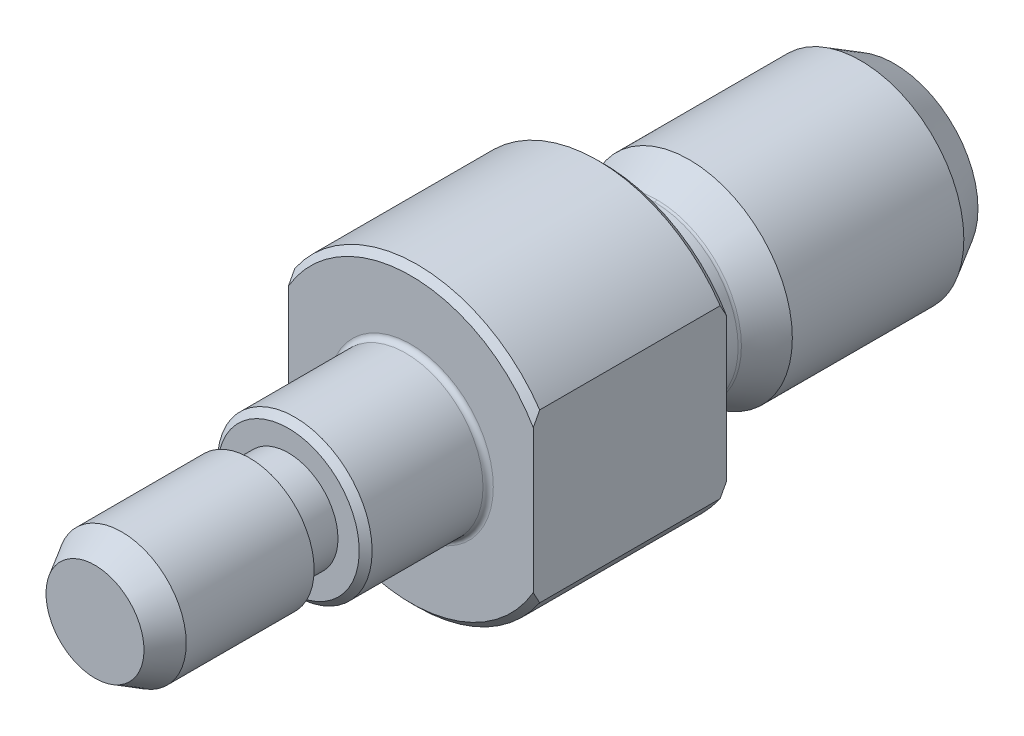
ISO-10303-21;
HEADER;
FILE_DESCRIPTION(('STEP AP214'),'2;1');
FILE_NAME('part.step','',(''),(''),'','','');
FILE_SCHEMA(('AUTOMOTIVE_DESIGN { 1 0 10303 214 1 1 1 1 }'));
ENDSEC;
DATA;
#1=APPLICATION_CONTEXT('core data for automotive mechanical design processes');
#2=APPLICATION_PROTOCOL_DEFINITION('international standard','automotive_design',2000,#1);
#3=PRODUCT_CONTEXT('',#1,'mechanical');
#4=PRODUCT('Part','Part','',(#3));
#5=PRODUCT_RELATED_PRODUCT_CATEGORY('part','',(#4));
#6=PRODUCT_DEFINITION_FORMATION('','',#4);
#7=PRODUCT_DEFINITION_CONTEXT('part definition',#1,'design');
#8=PRODUCT_DEFINITION('design','',#6,#7);
#9=PRODUCT_DEFINITION_SHAPE('','',#8);
#10=(LENGTH_UNIT() NAMED_UNIT(*) SI_UNIT(.MILLI.,.METRE.));
#11=(NAMED_UNIT(*) PLANE_ANGLE_UNIT() SI_UNIT($,.RADIAN.));
#12=(NAMED_UNIT(*) SI_UNIT($,.STERADIAN.) SOLID_ANGLE_UNIT());
#13=UNCERTAINTY_MEASURE_WITH_UNIT(LENGTH_MEASURE(1.E-05),#10,'distance_accuracy_value','');
#14=(GEOMETRIC_REPRESENTATION_CONTEXT(3) GLOBAL_UNCERTAINTY_ASSIGNED_CONTEXT((#13)) GLOBAL_UNIT_ASSIGNED_CONTEXT((#10,
#11,#12)) REPRESENTATION_CONTEXT('',''));
#15=CARTESIAN_POINT('',(0.,0.,0.));
#16=DIRECTION('',(0.,0.,1.));
#17=DIRECTION('',(1.,0.,0.));
#18=AXIS2_PLACEMENT_3D('',#15,#16,#17);
#19=CARTESIAN_POINT('',(-3.858832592,3.84560000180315,39.4999999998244));
#20=DIRECTION('',(0.,4.56493102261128E-11,1.));
#21=DIRECTION('',(0.,-1.,4.56493102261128E-11));
#22=AXIS2_PLACEMENT_3D('',#19,#20,#21);
#23=PLANE('',#22);
#24=CARTESIAN_POINT('',(0.,1.80314775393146E-09,39.5));
#25=DIRECTION('',(0.,-4.56493102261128E-11,-1.));
#26=DIRECTION('',(-1.,0.,0.));
#27=AXIS2_PLACEMENT_3D('',#24,#25,#26);
#28=CIRCLE('',#27,3.8);
#29=CARTESIAN_POINT('',(-3.8,1.80314775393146E-09,39.5));
#30=VERTEX_POINT('',#29);
#31=EDGE_CURVE('E19',#30,#30,#28,.T.);
#32=ORIENTED_EDGE('',*,*,#31,.F.);
#33=EDGE_LOOP('',(#32));
#34=FACE_BOUND('',#33,.T.);
#35=ADVANCED_FACE('F14',(#34),#23,.T.);
#36=CARTESIAN_POINT('',(0.,1.80314775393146E-09,39.5));
#37=DIRECTION('',(0.,-4.56493102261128E-11,-1.));
#38=DIRECTION('',(-1.,0.,0.));
#39=AXIS2_PLACEMENT_3D('',#36,#37,#38);
#40=CONICAL_SURFACE('',#39,3.8,0.523598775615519);
#41=ORIENTED_EDGE('',*,*,#31,.T.);
#42=EDGE_LOOP('',(#41));
#43=FACE_BOUND('',#42,.T.);
#44=CARTESIAN_POINT('',(0.,1.70826744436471E-09,37.421539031));
#45=DIRECTION('',(0.,4.56493102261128E-11,1.));
#46=DIRECTION('',(0.,-1.,4.56493102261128E-11));
#47=AXIS2_PLACEMENT_3D('',#44,#45,#46);
#48=CIRCLE('',#47,5.);
#49=CARTESIAN_POINT('',(0.,-4.99999999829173,37.4215390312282));
#50=VERTEX_POINT('',#49);
#51=EDGE_CURVE('E132',#50,#50,#48,.F.);
#52=ORIENTED_EDGE('',*,*,#51,.F.);
#53=EDGE_LOOP('',(#52));
#54=FACE_BOUND('',#53,.T.);
#55=ADVANCED_FACE('F358',(#43,#54),#40,.T.);
#56=CARTESIAN_POINT('',(0.,1.2553560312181E-09,27.5));
#57=DIRECTION('',(0.,4.56493102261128E-11,1.));
#58=DIRECTION('',(1.,0.,0.));
#59=AXIS2_PLACEMENT_3D('',#56,#57,#58);
#60=CYLINDRICAL_SURFACE('',#59,5.);
#61=CARTESIAN_POINT('',(0.,1.2553560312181E-09,27.5));
#62=DIRECTION('',(0.,4.56493102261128E-11,1.));
#63=DIRECTION('',(1.,0.,0.));
#64=AXIS2_PLACEMENT_3D('',#61,#62,#63);
#65=CIRCLE('',#64,5.);
#66=CARTESIAN_POINT('',(5.,1.2553560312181E-09,27.5));
#67=VERTEX_POINT('',#66);
#68=EDGE_CURVE('E134',#67,#67,#65,.F.);
#69=ORIENTED_EDGE('',*,*,#68,.F.);
#70=EDGE_LOOP('',(#69));
#71=FACE_BOUND('',#70,.T.);
#72=ORIENTED_EDGE('',*,*,#51,.T.);
#73=EDGE_LOOP('',(#72));
#74=FACE_BOUND('',#73,.T.);
#75=ADVANCED_FACE('F354',(#71,#74),#60,.T.);
#76=CARTESIAN_POINT('',(-6.600634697,-6.57800000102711,-22.4999999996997));
#77=DIRECTION('',(0.,-4.56493102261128E-11,-1.));
#78=DIRECTION('',(0.,1.,-4.56493102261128E-11));
#79=AXIS2_PLACEMENT_3D('',#76,#77,#78);
#80=PLANE('',#79);
#81=CARTESIAN_POINT('',(0.,-1.02710948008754E-09,-22.5));
#82=DIRECTION('',(0.,4.56493102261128E-11,1.));
#83=DIRECTION('',(1.,0.,0.));
#84=AXIS2_PLACEMENT_3D('',#81,#82,#83);
#85=CIRCLE('',#84,6.5);
#86=CARTESIAN_POINT('',(6.5,-1.02710948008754E-09,-22.5));
#87=VERTEX_POINT('',#86);
#88=EDGE_CURVE('E347',#87,#87,#85,.T.);
#89=ORIENTED_EDGE('',*,*,#88,.F.);
#90=EDGE_LOOP('',(#89));
#91=FACE_BOUND('',#90,.T.);
#92=ADVANCED_FACE('F357',(#91),#80,.T.);
#93=CARTESIAN_POINT('',(-5.077411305,-5.05999999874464,27.500000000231));
#94=DIRECTION('',(0.,-4.56493102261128E-11,-1.));
#95=DIRECTION('',(0.,1.,-4.56493102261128E-11));
#96=AXIS2_PLACEMENT_3D('',#93,#94,#95);
#97=PLANE('',#96);
#98=CARTESIAN_POINT('',(0.,1.2553560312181E-09,27.5));
#99=DIRECTION('',(0.,4.56493102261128E-11,1.));
#100=DIRECTION('',(1.,0.,0.));
#101=AXIS2_PLACEMENT_3D('',#98,#99,#100);
#102=CIRCLE('',#101,3.85);
#103=CARTESIAN_POINT('',(3.85,1.2553560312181E-09,27.5));
#104=VERTEX_POINT('',#103);
#105=EDGE_CURVE('E131',#104,#104,#102,.F.);
#106=ORIENTED_EDGE('',*,*,#105,.F.);
#107=EDGE_LOOP('',(#106));
#108=FACE_BOUND('',#107,.T.);
#109=ORIENTED_EDGE('',*,*,#68,.T.);
#110=EDGE_LOOP('',(#109));
#111=FACE_BOUND('',#110,.T.);
#112=ADVANCED_FACE('F352',(#108,#111),#97,.T.);
#113=CARTESIAN_POINT('',(0.,-1.02710948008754E-09,-22.5));
#114=DIRECTION('',(0.,4.56493102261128E-11,1.));
#115=DIRECTION('',(1.,0.,0.));
#116=AXIS2_PLACEMENT_3D('',#113,#114,#115);
#117=CONICAL_SURFACE('',#116,6.5,0.523598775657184);
#118=ORIENTED_EDGE('',*,*,#88,.T.);
#119=EDGE_LOOP('',(#118));
#120=FACE_BOUND('',#119,.T.);
#121=CARTESIAN_POINT('',(0.,-9.08509093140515E-10,-19.901923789));
#122=DIRECTION('',(0.,4.56493102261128E-11,1.));
#123=DIRECTION('',(0.,-1.,4.56493102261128E-11));
#124=AXIS2_PLACEMENT_3D('',#121,#122,#123);
#125=CIRCLE('',#124,8.);
#126=CARTESIAN_POINT('',(0.,-8.00000000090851,-19.9019237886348));
#127=VERTEX_POINT('',#126);
#128=EDGE_CURVE('E128',#127,#127,#125,.T.);
#129=ORIENTED_EDGE('',*,*,#128,.F.);
#130=EDGE_LOOP('',(#129));
#131=FACE_BOUND('',#130,.T.);
#132=ADVANCED_FACE('F372',(#120,#131),#117,.T.);
#133=CARTESIAN_POINT('',(0.,1.11840810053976E-09,24.5));
#134=DIRECTION('',(0.,4.56493102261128E-11,1.));
#135=DIRECTION('',(1.,0.,0.));
#136=AXIS2_PLACEMENT_3D('',#133,#134,#135);
#137=CYLINDRICAL_SURFACE('',#136,3.85);
#138=CARTESIAN_POINT('',(0.,1.11840810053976E-09,24.5));
#139=DIRECTION('',(0.,4.56493102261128E-11,1.));
#140=DIRECTION('',(1.,0.,0.));
#141=AXIS2_PLACEMENT_3D('',#138,#139,#140);
#142=CIRCLE('',#141,3.85);
#143=CARTESIAN_POINT('',(3.85,1.11840810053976E-09,24.5));
#144=VERTEX_POINT('',#143);
#145=EDGE_CURVE('E127',#144,#144,#142,.F.);
#146=ORIENTED_EDGE('',*,*,#145,.F.);
#147=EDGE_LOOP('',(#146));
#148=FACE_BOUND('',#147,.T.);
#149=ORIENTED_EDGE('',*,*,#105,.T.);
#150=EDGE_LOOP('',(#149));
#151=FACE_BOUND('',#150,.T.);
#152=ADVANCED_FACE('F375',(#148,#151),#137,.T.);
#153=CARTESIAN_POINT('',(0.,-9.08509093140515E-10,-19.901923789));
#154=DIRECTION('',(0.,4.56493102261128E-11,1.));
#155=DIRECTION('',(1.,0.,0.));
#156=AXIS2_PLACEMENT_3D('',#153,#154,#155);
#157=CYLINDRICAL_SURFACE('',#156,8.);
#158=ORIENTED_EDGE('',*,*,#128,.T.);
#159=EDGE_LOOP('',(#158));
#160=FACE_BOUND('',#159,.T.);
#161=CARTESIAN_POINT('',(0.,-3.01197627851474E-10,-6.598076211));
#162=DIRECTION('',(0.,-4.56493102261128E-11,-1.));
#163=DIRECTION('',(0.,1.,-4.56449734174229E-11));
#164=AXIS2_PLACEMENT_3D('',#161,#162,#163);
#165=CIRCLE('',#164,8.);
#166=CARTESIAN_POINT('',(0.,7.9999999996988,-6.59807621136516));
#167=VERTEX_POINT('',#166);
#168=EDGE_CURVE('E124',#167,#167,#165,.F.);
#169=ORIENTED_EDGE('',*,*,#168,.F.);
#170=EDGE_LOOP('',(#169));
#171=FACE_BOUND('',#170,.T.);
#172=ADVANCED_FACE('F378',(#160,#171),#157,.T.);
#173=CARTESIAN_POINT('',(-5.585152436,5.56600000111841,24.4999999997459));
#174=DIRECTION('',(0.,4.56493102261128E-11,1.));
#175=DIRECTION('',(0.,-1.,4.56493102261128E-11));
#176=AXIS2_PLACEMENT_3D('',#173,#174,#175);
#177=PLANE('',#176);
#178=ORIENTED_EDGE('',*,*,#145,.T.);
#179=EDGE_LOOP('',(#178));
#180=FACE_BOUND('',#179,.T.);
#181=CARTESIAN_POINT('',(0.,1.11840810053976E-09,24.5));
#182=DIRECTION('',(0.,-4.56493102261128E-11,-1.));
#183=DIRECTION('',(-1.,0.,0.));
#184=AXIS2_PLACEMENT_3D('',#181,#182,#183);
#185=CIRCLE('',#184,5.5);
#186=CARTESIAN_POINT('',(-5.5,1.11840810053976E-09,24.5));
#187=VERTEX_POINT('',#186);
#188=EDGE_CURVE('E107',#187,#187,#185,.T.);
#189=ORIENTED_EDGE('',*,*,#188,.F.);
#190=EDGE_LOOP('',(#189));
#191=FACE_BOUND('',#190,.T.);
#192=ADVANCED_FACE('F304',(#180,#191),#177,.T.);
#193=CARTESIAN_POINT('',(0.,-1.86834424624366E-10,-4.092820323));
#194=DIRECTION('',(0.,-4.56493102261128E-11,-1.));
#195=DIRECTION('',(-1.,0.,0.));
#196=AXIS2_PLACEMENT_3D('',#193,#194,#195);
#197=CONICAL_SURFACE('',#196,6.553589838,0.523598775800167);
#198=CARTESIAN_POINT('',(0.,-1.86834424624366E-10,-4.092820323));
#199=DIRECTION('',(0.,-4.56493102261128E-11,-1.));
#200=DIRECTION('',(-1.,0.,0.));
#201=AXIS2_PLACEMENT_3D('',#198,#199,#200);
#202=CIRCLE('',#201,6.553589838);
#203=CARTESIAN_POINT('',(-2.94235305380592E-10,6.55358983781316,-4.09282032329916));
#204=VERTEX_POINT('',#203);
#205=CARTESIAN_POINT('',(-6.72081872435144E-10,-6.55358983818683,-4.09282032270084));
#206=VERTEX_POINT('',#205);
#207=EDGE_CURVE('E102',#204,#206,#202,.T.);
#208=ORIENTED_EDGE('',*,*,#207,.T.);
#209=CARTESIAN_POINT('',(0.,-1.86834424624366E-10,-4.092820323));
#210=DIRECTION('',(0.,-4.56493102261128E-11,-1.));
#211=DIRECTION('',(-1.,0.,0.));
#212=AXIS2_PLACEMENT_3D('',#209,#210,#211);
#213=CIRCLE('',#212,6.553589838);
#214=EDGE_CURVE('E100',#206,#204,#213,.T.);
#215=ORIENTED_EDGE('',*,*,#214,.T.);
#216=EDGE_LOOP('',(#208,#215));
#217=FACE_BOUND('',#216,.T.);
#218=ORIENTED_EDGE('',*,*,#168,.T.);
#219=EDGE_LOOP('',(#218));
#220=FACE_BOUND('',#219,.T.);
#221=ADVANCED_FACE('F103',(#217,#220),#197,.T.);
#222=CARTESIAN_POINT('',(0.,1.11840810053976E-09,24.5));
#223=DIRECTION('',(0.,-4.56493102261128E-11,-1.));
#224=DIRECTION('',(-1.,0.,0.));
#225=AXIS2_PLACEMENT_3D('',#222,#223,#224);
#226=CONICAL_SURFACE('',#225,5.5,0.785398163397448);
#227=ORIENTED_EDGE('',*,*,#188,.T.);
#228=EDGE_LOOP('',(#227));
#229=FACE_BOUND('',#228,.T.);
#230=CARTESIAN_POINT('',(0.,1.09558344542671E-09,24.));
#231=DIRECTION('',(0.,4.56493102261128E-11,1.));
#232=DIRECTION('',(0.,-1.,4.56493102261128E-11));
#233=AXIS2_PLACEMENT_3D('',#230,#231,#232);
#234=CIRCLE('',#233,6.);
#235=CARTESIAN_POINT('',(0.,-5.99999999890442,24.0000000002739));
#236=VERTEX_POINT('',#235);
#237=EDGE_CURVE('E117',#236,#236,#234,.F.);
#238=ORIENTED_EDGE('',*,*,#237,.F.);
#239=EDGE_LOOP('',(#238));
#240=FACE_BOUND('',#239,.T.);
#241=ADVANCED_FACE('F293',(#229,#240),#226,.T.);
#242=CARTESIAN_POINT('',(0.,-6.55358983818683,-4.09282032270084));
#243=CARTESIAN_POINT('',(13.107179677,-6.55358983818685,-4.09282032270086));
#244=CARTESIAN_POINT('',(13.107179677,6.55358983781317,-4.09282032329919));
#245=CARTESIAN_POINT('',(0.,6.55358983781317,-4.09282032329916));
#246=CARTESIAN_POINT('',(0.,-6.51827849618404,-4.03165928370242));
#247=CARTESIAN_POINT('',(13.036556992,-6.51827849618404,-4.03165928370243));
#248=CARTESIAN_POINT('',(13.036556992,6.51827849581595,-4.03165928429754));
#249=CARTESIAN_POINT('',(0.,6.51827849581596,-4.03165928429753));
#250=CARTESIAN_POINT('',(0.,-6.50000000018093,-3.96344300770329));
#251=CARTESIAN_POINT('',(13.,-6.50000000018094,-3.96344300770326));
#252=CARTESIAN_POINT('',(13.,6.49999999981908,-3.9634430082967));
#253=CARTESIAN_POINT('',(0.,6.49999999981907,-3.96344300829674));
#254=CARTESIAN_POINT('',(0.,-6.5000000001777,-3.89282032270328));
#255=CARTESIAN_POINT('',(13.,-6.50000000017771,-3.89282032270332));
#256=CARTESIAN_POINT('',(13.,6.4999999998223,-3.89282032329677));
#257=CARTESIAN_POINT('',(0.,6.4999999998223,-3.89282032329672));
#258=(BOUNDED_SURFACE() B_SPLINE_SURFACE(3,3,((#242,#243,#244,#245),(#246,#247,#248,#249),(#250,
#251,#252,#253),(#254,#255,#256,#257)),.UNSPECIFIED.,.F.,.F.,
.F.) B_SPLINE_SURFACE_WITH_KNOTS((4,4),(4,4),(0.,1.),(0.,1.),
.UNSPECIFIED.) GEOMETRIC_REPRESENTATION_ITEM() RATIONAL_B_SPLINE_SURFACE(((1.,0.333333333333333,
0.333333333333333,1.),(0.977283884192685,0.325761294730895,0.325761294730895,0.977283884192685),
(0.977283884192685,0.325761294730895,0.325761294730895,0.977283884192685),(1.,0.333333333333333,
0.333333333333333,1.))) REPRESENTATION_ITEM('') SURFACE());
#259=CARTESIAN_POINT('',(0.,-1.77704562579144E-10,-3.892820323));
#260=DIRECTION('',(0.,4.56493102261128E-11,1.));
#261=DIRECTION('',(0.,-1.,4.56493102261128E-11));
#262=AXIS2_PLACEMENT_3D('',#259,#260,#261);
#263=CIRCLE('',#262,6.5);
#264=CARTESIAN_POINT('',(-8.75487877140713E-10,-6.5000000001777,-3.89282032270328));
#265=VERTEX_POINT('',#264);
#266=CARTESIAN_POINT('',(-1.9997584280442E-09,6.4999999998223,-3.89282032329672));
#267=VERTEX_POINT('',#266);
#268=EDGE_CURVE('E92',#265,#267,#263,.T.);
#269=CARTESIAN_POINT('',(0.,-6.55358983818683,-4.09282032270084));
#270=CARTESIAN_POINT('',(0.,-6.51827849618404,-4.03165928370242));
#271=CARTESIAN_POINT('',(0.,-6.50000000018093,-3.96344300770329));
#272=CARTESIAN_POINT('',(0.,-6.5000000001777,-3.89282032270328));
#273=(BOUNDED_CURVE() B_SPLINE_CURVE(3,(#269,#270,#271,#272),.UNSPECIFIED.,.F.,
.F.) B_SPLINE_CURVE_WITH_KNOTS((4,4),(0.,1.),
.UNSPECIFIED.) CURVE() GEOMETRIC_REPRESENTATION_ITEM() RATIONAL_B_SPLINE_CURVE((1.,
0.977283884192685,0.977283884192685,1.)) REPRESENTATION_ITEM(''));
#274=EDGE_CURVE('E106',#265,#206,#273,.F.);
#275=CARTESIAN_POINT('',(0.,6.55358983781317,-4.09282032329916));
#276=CARTESIAN_POINT('',(0.,6.51827849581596,-4.03165928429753));
#277=CARTESIAN_POINT('',(0.,6.49999999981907,-3.96344300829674));
#278=CARTESIAN_POINT('',(0.,6.4999999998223,-3.89282032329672));
#279=(BOUNDED_CURVE() B_SPLINE_CURVE(3,(#275,#276,#277,#278),.UNSPECIFIED.,.F.,
.F.) B_SPLINE_CURVE_WITH_KNOTS((4,4),(0.,1.),
.UNSPECIFIED.) CURVE() GEOMETRIC_REPRESENTATION_ITEM() RATIONAL_B_SPLINE_CURVE((1.,
0.977283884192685,0.977283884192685,1.)) REPRESENTATION_ITEM(''));
#280=EDGE_CURVE('E115',#204,#267,#279,.T.);
#281=ORIENTED_EDGE('',*,*,#268,.F.);
#282=ORIENTED_EDGE('',*,*,#274,.T.);
#283=ORIENTED_EDGE('',*,*,#207,.F.);
#284=ORIENTED_EDGE('',*,*,#280,.T.);
#285=EDGE_LOOP('',(#281,#282,#283,#284));
#286=FACE_BOUND('',#285,.T.);
#287=ADVANCED_FACE('F109',(#286),#258,.F.);
#288=CARTESIAN_POINT('',(0.,6.55358983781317,-4.09282032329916));
#289=CARTESIAN_POINT('',(-13.107179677,6.55358983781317,-4.09282032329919));
#290=CARTESIAN_POINT('',(-13.107179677,-6.55358983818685,-4.09282032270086));
#291=CARTESIAN_POINT('',(0.,-6.55358983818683,-4.09282032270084));
#292=CARTESIAN_POINT('',(0.,6.51827849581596,-4.03165928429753));
#293=CARTESIAN_POINT('',(-13.036556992,6.51827849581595,-4.03165928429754));
#294=CARTESIAN_POINT('',(-13.036556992,-6.51827849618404,-4.03165928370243));
#295=CARTESIAN_POINT('',(0.,-6.51827849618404,-4.03165928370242));
#296=CARTESIAN_POINT('',(0.,6.49999999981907,-3.96344300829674));
#297=CARTESIAN_POINT('',(-13.,6.49999999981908,-3.9634430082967));
#298=CARTESIAN_POINT('',(-13.,-6.50000000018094,-3.96344300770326));
#299=CARTESIAN_POINT('',(0.,-6.50000000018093,-3.96344300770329));
#300=CARTESIAN_POINT('',(0.,6.4999999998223,-3.89282032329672));
#301=CARTESIAN_POINT('',(-13.,6.4999999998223,-3.89282032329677));
#302=CARTESIAN_POINT('',(-13.,-6.50000000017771,-3.89282032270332));
#303=CARTESIAN_POINT('',(0.,-6.5000000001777,-3.89282032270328));
#304=(BOUNDED_SURFACE() B_SPLINE_SURFACE(3,3,((#288,#289,#290,#291),(#292,#293,#294,#295),(#296,
#297,#298,#299),(#300,#301,#302,#303)),.UNSPECIFIED.,.F.,.F.,
.F.) B_SPLINE_SURFACE_WITH_KNOTS((4,4),(4,4),(0.,1.),(0.,1.),
.UNSPECIFIED.) GEOMETRIC_REPRESENTATION_ITEM() RATIONAL_B_SPLINE_SURFACE(((1.,0.333333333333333,
0.333333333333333,1.),(0.977283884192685,0.325761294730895,0.325761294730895,0.977283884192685),
(0.977283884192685,0.325761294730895,0.325761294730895,0.977283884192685),(1.,0.333333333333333,
0.333333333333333,1.))) REPRESENTATION_ITEM('') SURFACE());
#305=CARTESIAN_POINT('',(0.,-1.77704562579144E-10,-3.892820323));
#306=DIRECTION('',(0.,4.56493102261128E-11,1.));
#307=DIRECTION('',(0.,-1.,4.56493102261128E-11));
#308=AXIS2_PLACEMENT_3D('',#305,#306,#307);
#309=CIRCLE('',#308,6.5);
#310=EDGE_CURVE('E267',#267,#265,#309,.T.);
#311=ORIENTED_EDGE('',*,*,#280,.F.);
#312=ORIENTED_EDGE('',*,*,#214,.F.);
#313=ORIENTED_EDGE('',*,*,#274,.F.);
#314=ORIENTED_EDGE('',*,*,#310,.F.);
#315=EDGE_LOOP('',(#311,#312,#313,#314));
#316=FACE_BOUND('',#315,.T.);
#317=ADVANCED_FACE('F114',(#316),#304,.F.);
#318=CARTESIAN_POINT('',(0.,7.02999377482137E-10,15.4));
#319=DIRECTION('',(0.,4.56493102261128E-11,1.));
#320=DIRECTION('',(1.,0.,0.));
#321=AXIS2_PLACEMENT_3D('',#318,#319,#320);
#322=CYLINDRICAL_SURFACE('',#321,6.);
#323=CARTESIAN_POINT('',(0.,7.02999377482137E-10,15.4));
#324=DIRECTION('',(0.,4.56493102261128E-11,1.));
#325=DIRECTION('',(1.,0.,0.));
#326=AXIS2_PLACEMENT_3D('',#323,#324,#325);
#327=CIRCLE('',#326,6.);
#328=CARTESIAN_POINT('',(6.,7.02999377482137E-10,15.4));
#329=VERTEX_POINT('',#328);
#330=EDGE_CURVE('E264',#329,#329,#327,.T.);
#331=ORIENTED_EDGE('',*,*,#330,.T.);
#332=EDGE_LOOP('',(#331));
#333=FACE_BOUND('',#332,.T.);
#334=ORIENTED_EDGE('',*,*,#237,.T.);
#335=EDGE_LOOP('',(#334));
#336=FACE_BOUND('',#335,.T.);
#337=ADVANCED_FACE('F291',(#333,#336),#322,.T.);
#338=CARTESIAN_POINT('',(0.,-1.77704562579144E-10,-3.892820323));
#339=DIRECTION('',(0.,4.56493102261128E-11,1.));
#340=DIRECTION('',(1.,0.,0.));
#341=AXIS2_PLACEMENT_3D('',#338,#339,#340);
#342=CYLINDRICAL_SURFACE('',#341,6.5);
#343=ORIENTED_EDGE('',*,*,#268,.T.);
#344=ORIENTED_EDGE('',*,*,#310,.T.);
#345=EDGE_LOOP('',(#343,#344));
#346=FACE_BOUND('',#345,.T.);
#347=CARTESIAN_POINT('',(0.,-1.82597240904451E-11,-0.4));
#348=DIRECTION('',(0.,-4.56493102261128E-11,-1.));
#349=DIRECTION('',(-1.,0.,0.));
#350=AXIS2_PLACEMENT_3D('',#347,#348,#349);
#351=CIRCLE('',#350,6.5);
#352=CARTESIAN_POINT('',(-6.5,-1.82597240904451E-11,-0.4));
#353=VERTEX_POINT('',#352);
#354=EDGE_CURVE('E261',#353,#353,#351,.T.);
#355=ORIENTED_EDGE('',*,*,#354,.T.);
#356=EDGE_LOOP('',(#355));
#357=FACE_BOUND('',#356,.T.);
#358=ADVANCED_FACE('F327',(#346,#357),#342,.T.);
#359=CARTESIAN_POINT('',(0.,7.02999377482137E-10,15.4));
#360=DIRECTION('',(0.,4.56493102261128E-11,1.));
#361=DIRECTION('',(1.,0.,0.));
#362=AXIS2_PLACEMENT_3D('',#359,#360,#361);
#363=TOROIDAL_SURFACE('',#362,6.4,0.4);
#364=CARTESIAN_POINT('',(0.,6.84739653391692E-10,15.));
#365=DIRECTION('',(0.,4.56493102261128E-11,1.));
#366=DIRECTION('',(1.,0.,0.));
#367=AXIS2_PLACEMENT_3D('',#364,#365,#366);
#368=CIRCLE('',#367,6.40000000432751);
#369=CARTESIAN_POINT('',(6.40000000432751,6.84739653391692E-10,15.));
#370=VERTEX_POINT('',#369);
#371=EDGE_CURVE('E341',#370,#370,#368,.F.);
#372=ORIENTED_EDGE('',*,*,#371,.F.);
#373=EDGE_LOOP('',(#372));
#374=FACE_BOUND('',#373,.T.);
#375=ORIENTED_EDGE('',*,*,#330,.F.);
#376=EDGE_LOOP('',(#375));
#377=FACE_BOUND('',#376,.T.);
#378=ADVANCED_FACE('F330',(#374,#377),#363,.F.);
#379=CARTESIAN_POINT('',(0.,-1.82597240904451E-11,-0.4));
#380=DIRECTION('',(0.,4.56493102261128E-11,1.));
#381=DIRECTION('',(1.,0.,0.));
#382=AXIS2_PLACEMENT_3D('',#379,#380,#381);
#383=TOROIDAL_SURFACE('',#382,6.9,0.4);
#384=ORIENTED_EDGE('',*,*,#354,.F.);
#385=EDGE_LOOP('',(#384));
#386=FACE_BOUND('',#385,.T.);
#387=CARTESIAN_POINT('',(0.,0.,0.));
#388=DIRECTION('',(0.,4.56493102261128E-11,1.));
#389=DIRECTION('',(1.,0.,0.));
#390=AXIS2_PLACEMENT_3D('',#387,#388,#389);
#391=CIRCLE('',#390,6.8999999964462);
#392=CARTESIAN_POINT('',(6.8999999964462,0.,0.));
#393=VERTEX_POINT('',#392);
#394=EDGE_CURVE('E164',#393,#393,#391,.T.);
#395=ORIENTED_EDGE('',*,*,#394,.F.);
#396=EDGE_LOOP('',(#395));
#397=FACE_BOUND('',#396,.T.);
#398=ADVANCED_FACE('F179',(#386,#397),#383,.F.);
#399=CARTESIAN_POINT('',(9.5,6.48074069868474,14.9999999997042));
#400=DIRECTION('',(1.,0.,0.));
#401=DIRECTION('',(0.,-1.,4.56493102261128E-11));
#402=AXIS2_PLACEMENT_3D('',#399,#400,#401);
#403=PLANE('',#402);
#404=DIRECTION('',(0.,1.,-4.56493102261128E-11));
#405=VECTOR('',#404,1.);
#406=CARTESIAN_POINT('',(9.5,-0.0461727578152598,15.0000000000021));
#407=LINE('',#406,#405);
#408=CARTESIAN_POINT('',(9.5,-5.54526825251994,15.0000000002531));
#409=VERTEX_POINT('',#408);
#410=CARTESIAN_POINT('',(9.5,5.545268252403,15.0000000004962));
#411=VERTEX_POINT('',#410);
#412=EDGE_CURVE('E254',#409,#411,#407,.T.);
#413=ORIENTED_EDGE('',*,*,#412,.F.);
#414=CARTESIAN_POINT('',(9.4999999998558,-6.48074069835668,14.4999999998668));
#415=CARTESIAN_POINT('',(9.49999999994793,-6.40372265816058,14.5434024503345));
#416=CARTESIAN_POINT('',(9.49999999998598,-6.32647872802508,14.5864052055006));
#417=CARTESIAN_POINT('',(9.50000000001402,-6.17153461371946,14.6715558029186));
#418=CARTESIAN_POINT('',(9.500000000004,-6.09383449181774,14.7137037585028));
#419=CARTESIAN_POINT('',(9.499999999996,-5.93795223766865,14.7971012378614));
#420=CARTESIAN_POINT('',(9.499999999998,-5.85977010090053,14.8383507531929));
#421=CARTESIAN_POINT('',(9.500000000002,-5.70289977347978,14.9199016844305));
#422=CARTESIAN_POINT('',(9.50000000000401,-5.62421151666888,14.9602029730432));
#423=CARTESIAN_POINT('',(9.5,-5.54526824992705,15.0000000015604));
#424=B_SPLINE_CURVE_WITH_KNOTS('',3,(#414,#415,#416,#417,#418,#419,#420,#421,#422,#423),
.UNSPECIFIED.,.F.,.F.,(4,2,2,2,4),(0.,0.265216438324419,0.530397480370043,0.795581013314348,
1.06079994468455),.UNSPECIFIED.);
#425=CARTESIAN_POINT('',(9.50000000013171,-6.48074069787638,14.5000000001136));
#426=VERTEX_POINT('',#425);
#427=EDGE_CURVE('E187',#426,#409,#424,.T.);
#428=ORIENTED_EDGE('',*,*,#427,.F.);
#429=DIRECTION('',(0.,4.56493102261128E-11,1.));
#430=VECTOR('',#429,1.);
#431=CARTESIAN_POINT('',(9.50000000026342,-6.48074069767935,7.50000000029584));
#432=LINE('',#431,#430);
#433=CARTESIAN_POINT('',(9.50000000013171,-6.48074069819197,0.50000000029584));
#434=VERTEX_POINT('',#433);
#435=EDGE_CURVE('E251',#434,#426,#432,.T.);
#436=ORIENTED_EDGE('',*,*,#435,.F.);
#437=CARTESIAN_POINT('',(9.50000000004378,-5.54526824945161,-1.6629614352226E-09));
#438=CARTESIAN_POINT('',(9.50000000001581,-5.62421151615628,0.0397970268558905));
#439=CARTESIAN_POINT('',(9.50000000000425,-5.70289977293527,0.0800983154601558));
#440=CARTESIAN_POINT('',(9.49999999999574,-5.85977010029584,0.161649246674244));
#441=CARTESIAN_POINT('',(9.49999999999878,-5.93795223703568,0.202898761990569));
#442=CARTESIAN_POINT('',(9.50000000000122,-6.09383449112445,0.286296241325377));
#443=CARTESIAN_POINT('',(9.50000000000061,-6.17153461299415,0.328444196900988));
#444=CARTESIAN_POINT('',(9.49999999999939,-6.3264787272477,0.413594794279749));
#445=CARTESIAN_POINT('',(9.49999999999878,-6.40372265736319,0.456597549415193));
#446=CARTESIAN_POINT('',(9.5,-6.48074069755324,0.499999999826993));
#447=B_SPLINE_CURVE_WITH_KNOTS('',3,(#437,#438,#439,#440,#441,#442,#443,#444,#445,#446),
.UNSPECIFIED.,.F.,.F.,(4,2,2,2,4),(0.,0.265218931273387,0.530402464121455,0.79558350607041,
1.06079994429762),.UNSPECIFIED.);
#448=CARTESIAN_POINT('',(9.5,-5.54526825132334,-6.95311863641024E-10));
#449=VERTEX_POINT('',#448);
#450=EDGE_CURVE('E154',#449,#434,#447,.T.);
#451=ORIENTED_EDGE('',*,*,#450,.F.);
#452=DIRECTION('',(0.,-1.,4.56493102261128E-11));
#453=VECTOR('',#452,1.);
#454=CARTESIAN_POINT('',(9.5,0.0461727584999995,-2.1094237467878E-12));
#455=LINE('',#454,#453);
#456=CARTESIAN_POINT('',(9.5,5.54526825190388,-9.08891018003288E-10));
#457=VERTEX_POINT('',#456);
#458=EDGE_CURVE('E234',#457,#449,#455,.T.);
#459=ORIENTED_EDGE('',*,*,#458,.F.);
#460=CARTESIAN_POINT('',(9.49999999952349,6.48074069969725,0.500000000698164));
#461=CARTESIAN_POINT('',(9.49999999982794,6.4037226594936,0.456597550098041));
#462=CARTESIAN_POINT('',(9.49999999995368,6.32647872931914,0.413594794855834));
#463=CARTESIAN_POINT('',(9.50000000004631,6.17153461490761,0.328444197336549));
#464=CARTESIAN_POINT('',(9.50000000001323,6.09383449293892,0.286296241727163));
#465=CARTESIAN_POINT('',(9.49999999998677,5.93795223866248,0.202898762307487));
#466=CARTESIAN_POINT('',(9.49999999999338,5.85977010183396,0.161649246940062));
#467=CARTESIAN_POINT('',(9.50000000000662,5.70289977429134,0.0800983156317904));
#468=CARTESIAN_POINT('',(9.50000000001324,5.62421151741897,0.0397970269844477));
#469=CARTESIAN_POINT('',(9.5,5.54526825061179,-1.56039070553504E-09));
#470=B_SPLINE_CURVE_WITH_KNOTS('',3,(#460,#461,#462,#463,#464,#465,#466,#467,#468,#469),
.UNSPECIFIED.,.F.,.F.,(4,2,2,2,4),(0.,0.265216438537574,0.530397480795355,0.795581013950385,
1.06079994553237),.UNSPECIFIED.);
#471=CARTESIAN_POINT('',(9.49999999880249,6.48074070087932,0.500000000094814));
#472=VERTEX_POINT('',#471);
#473=EDGE_CURVE('E194',#472,#457,#470,.T.);
#474=ORIENTED_EDGE('',*,*,#473,.F.);
#475=DIRECTION('',(0.,-4.56493102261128E-11,-1.));
#476=VECTOR('',#475,1.);
#477=CARTESIAN_POINT('',(9.49999999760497,6.48074070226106,7.49999999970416));
#478=LINE('',#477,#476);
#479=CARTESIAN_POINT('',(9.49999999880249,6.48074070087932,14.4999999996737));
#480=VERTEX_POINT('',#479);
#481=EDGE_CURVE('E250',#480,#472,#478,.T.);
#482=ORIENTED_EDGE('',*,*,#481,.F.);
#483=CARTESIAN_POINT('',(9.49999999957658,6.48074069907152,14.4999999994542));
#484=CARTESIAN_POINT('',(9.49999999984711,6.40372265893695,14.5434024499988));
#485=CARTESIAN_POINT('',(9.49999999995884,6.32647872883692,14.5864052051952));
#486=CARTESIAN_POINT('',(9.50000000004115,6.17153461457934,14.6715558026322));
#487=CARTESIAN_POINT('',(9.50000000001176,6.09383449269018,14.7137037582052));
#488=CARTESIAN_POINT('',(9.49999999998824,5.93795223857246,14.7971012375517));
#489=CARTESIAN_POINT('',(9.49999999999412,5.85977010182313,14.8383507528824));
#490=CARTESIAN_POINT('',(9.50000000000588,5.7028997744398,14.919901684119));
#491=CARTESIAN_POINT('',(9.50000000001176,5.62421151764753,14.9602029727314));
#492=CARTESIAN_POINT('',(9.5,5.54526825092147,15.0000000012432));
#493=B_SPLINE_CURVE_WITH_KNOTS('',3,(#483,#484,#485,#486,#487,#488,#489,#490,#491,#492),
.UNSPECIFIED.,.F.,.F.,(4,2,2,2,4),(0.,0.265216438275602,0.530397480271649,0.795581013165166,
1.06079994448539),.UNSPECIFIED.);
#494=EDGE_CURVE('E80',#480,#411,#493,.T.);
#495=ORIENTED_EDGE('',*,*,#494,.T.);
#496=EDGE_LOOP('',(#413,#428,#436,#451,#459,#474,#482,#495));
#497=FACE_BOUND('',#496,.T.);
#498=ADVANCED_FACE('F173',(#497),#403,.T.);
#499=CARTESIAN_POINT('',(-9.5,11.1325540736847,14.9999999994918));
#500=DIRECTION('',(0.,4.56493102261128E-11,1.));
#501=DIRECTION('',(0.,-1.,4.56493102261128E-11));
#502=AXIS2_PLACEMENT_3D('',#499,#500,#501);
#503=PLANE('',#502);
#504=ORIENTED_EDGE('',*,*,#371,.T.);
#505=EDGE_LOOP('',(#504));
#506=FACE_BOUND('',#505,.T.);
#507=CARTESIAN_POINT('',(0.,6.84739653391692E-10,15.));
#508=DIRECTION('',(0.,-4.56493102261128E-11,-1.));
#509=DIRECTION('',(-1.,0.,0.));
#510=AXIS2_PLACEMENT_3D('',#507,#508,#509);
#511=CIRCLE('',#510,11.);
#512=CARTESIAN_POINT('',(-9.5,-5.54526825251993,15.0000000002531));
#513=VERTEX_POINT('',#512);
#514=EDGE_CURVE('E201',#409,#513,#511,.T.);
#515=ORIENTED_EDGE('',*,*,#514,.F.);
#516=ORIENTED_EDGE('',*,*,#412,.T.);
#517=CARTESIAN_POINT('',(0.,6.84739653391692E-10,15.));
#518=DIRECTION('',(0.,-4.56493102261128E-11,-1.));
#519=DIRECTION('',(-1.,0.,0.));
#520=AXIS2_PLACEMENT_3D('',#517,#518,#519);
#521=CIRCLE('',#520,11.);
#522=CARTESIAN_POINT('',(-9.5,5.54526825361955,14.9999999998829));
#523=VERTEX_POINT('',#522);
#524=EDGE_CURVE('E84',#523,#411,#521,.T.);
#525=ORIENTED_EDGE('',*,*,#524,.F.);
#526=DIRECTION('',(0.,1.,-4.56493102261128E-11));
#527=VECTOR('',#526,1.);
#528=CARTESIAN_POINT('',(-9.5,6.84739653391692E-10,15.));
#529=LINE('',#528,#527);
#530=EDGE_CURVE('E239',#513,#523,#529,.T.);
#531=ORIENTED_EDGE('',*,*,#530,.F.);
#532=EDGE_LOOP('',(#515,#516,#525,#531));
#533=FACE_BOUND('',#532,.T.);
#534=ADVANCED_FACE('F178',(#506,#533),#503,.T.);
#535=CARTESIAN_POINT('',(0.,6.84739653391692E-10,15.));
#536=DIRECTION('',(0.,-4.56493102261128E-11,-1.));
#537=DIRECTION('',(-1.,0.,0.));
#538=AXIS2_PLACEMENT_3D('',#535,#536,#537);
#539=CONICAL_SURFACE('',#538,11.,0.785398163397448);
#540=CARTESIAN_POINT('',(0.,6.61914998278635E-10,14.5));
#541=DIRECTION('',(0.,4.56493102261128E-11,1.));
#542=DIRECTION('',(0.,-1.,4.56493102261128E-11));
#543=AXIS2_PLACEMENT_3D('',#540,#541,#542);
#544=CIRCLE('',#543,11.5);
#545=CARTESIAN_POINT('',(-9.5,6.48074069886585,14.4999999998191));
#546=VERTEX_POINT('',#545);
#547=EDGE_CURVE('E256',#546,#480,#544,.F.);
#548=ORIENTED_EDGE('',*,*,#547,.F.);
#549=CARTESIAN_POINT('',(-9.5,5.54526825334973,15.0000000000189));
#550=CARTESIAN_POINT('',(-9.5,5.6242115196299,14.9602029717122));
#551=CARTESIAN_POINT('',(-9.5,5.70289977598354,14.9199016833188));
#552=CARTESIAN_POINT('',(-9.5,5.8597701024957,14.8383507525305));
#553=CARTESIAN_POINT('',(-9.5,5.93795223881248,14.7971012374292));
#554=CARTESIAN_POINT('',(-9.5,6.09383449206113,14.7137037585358));
#555=CARTESIAN_POINT('',(-9.5,6.17153461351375,14.6715558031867));
#556=CARTESIAN_POINT('',(-9.5,6.32647872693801,14.5864052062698));
#557=CARTESIAN_POINT('',(-9.5,6.40372265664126,14.5434024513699));
#558=CARTESIAN_POINT('',(-9.5,6.48074069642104,14.5000000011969));
#559=B_SPLINE_CURVE_WITH_KNOTS('',3,(#549,#550,#551,#552,#553,#554,#555,#556,#557,#558),
.UNSPECIFIED.,.F.,.F.,(4,2,2,2,4),(0.,0.265218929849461,0.530402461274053,0.795583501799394,
1.06079993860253),.UNSPECIFIED.);
#560=EDGE_CURVE('E165',#523,#546,#559,.T.);
#561=ORIENTED_EDGE('',*,*,#560,.F.);
#562=ORIENTED_EDGE('',*,*,#524,.T.);
#563=ORIENTED_EDGE('',*,*,#494,.F.);
#564=EDGE_LOOP('',(#548,#561,#562,#563));
#565=FACE_BOUND('',#564,.T.);
#566=ADVANCED_FACE('F332',(#565),#539,.T.);
#567=CARTESIAN_POINT('',(0.,2.28246551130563E-11,0.5));
#568=DIRECTION('',(0.,4.56493102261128E-11,1.));
#569=DIRECTION('',(1.,0.,0.));
#570=AXIS2_PLACEMENT_3D('',#567,#568,#569);
#571=CYLINDRICAL_SURFACE('',#570,11.5);
#572=ORIENTED_EDGE('',*,*,#547,.T.);
#573=ORIENTED_EDGE('',*,*,#481,.T.);
#574=CARTESIAN_POINT('',(0.,2.28246551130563E-11,0.5));
#575=DIRECTION('',(0.,4.56493102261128E-11,1.));
#576=DIRECTION('',(0.,-1.,4.56523271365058E-11));
#577=AXIS2_PLACEMENT_3D('',#574,#575,#576);
#578=CIRCLE('',#577,11.5);
#579=CARTESIAN_POINT('',(-9.5,6.48074069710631,0.499999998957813));
#580=VERTEX_POINT('',#579);
#581=EDGE_CURVE('E202',#580,#472,#578,.F.);
#582=ORIENTED_EDGE('',*,*,#581,.F.);
#583=DIRECTION('',(0.,-4.56493102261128E-11,-1.));
#584=VECTOR('',#583,1.);
#585=CARTESIAN_POINT('',(-9.5,6.48074069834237,7.49999999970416));
#586=LINE('',#585,#584);
#587=EDGE_CURVE('E220',#546,#580,#586,.T.);
#588=ORIENTED_EDGE('',*,*,#587,.F.);
#589=EDGE_LOOP('',(#572,#573,#582,#588));
#590=FACE_BOUND('',#589,.T.);
#591=ADVANCED_FACE('F209',(#590),#571,.T.);
#592=CARTESIAN_POINT('',(0.,0.,0.));
#593=DIRECTION('',(0.,4.56493102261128E-11,1.));
#594=DIRECTION('',(1.,0.,0.));
#595=AXIS2_PLACEMENT_3D('',#592,#593,#594);
#596=CONICAL_SURFACE('',#595,11.,0.785398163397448);
#597=ORIENTED_EDGE('',*,*,#581,.T.);
#598=ORIENTED_EDGE('',*,*,#473,.T.);
#599=CARTESIAN_POINT('',(0.,0.,0.));
#600=DIRECTION('',(0.,4.56493102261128E-11,1.));
#601=DIRECTION('',(1.,0.,0.));
#602=AXIS2_PLACEMENT_3D('',#599,#600,#601);
#603=CIRCLE('',#602,11.);
#604=CARTESIAN_POINT('',(-9.5,5.54526825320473,-2.53137788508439E-10));
#605=VERTEX_POINT('',#604);
#606=EDGE_CURVE('E422',#605,#457,#603,.F.);
#607=ORIENTED_EDGE('',*,*,#606,.F.);
#608=CARTESIAN_POINT('',(-9.5,6.48074069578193,0.499999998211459));
#609=CARTESIAN_POINT('',(-9.5,6.40372265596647,0.456597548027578));
#610=CARTESIAN_POINT('',(-9.5,6.32647872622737,0.413594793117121));
#611=CARTESIAN_POINT('',(-9.5,6.17153461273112,0.328444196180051));
#612=CARTESIAN_POINT('',(-9.5,6.09383449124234,0.286296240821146));
#613=CARTESIAN_POINT('',(-9.5,5.93795223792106,0.202898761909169));
#614=CARTESIAN_POINT('',(-9.5,5.85977010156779,0.161649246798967));
#615=CARTESIAN_POINT('',(-9.5,5.70289977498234,0.0800983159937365));
#616=CARTESIAN_POINT('',(-9.5,5.62421151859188,0.0397970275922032));
#617=CARTESIAN_POINT('',(-9.5,5.54526825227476,-7.22089055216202E-10));
#618=B_SPLINE_CURVE_WITH_KNOTS('',3,(#608,#609,#610,#611,#612,#613,#614,#615,#616,#617),
.UNSPECIFIED.,.F.,.F.,(4,2,2,2,4),(0.,0.265216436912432,0.530397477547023,0.795581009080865,
1.06079993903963),.UNSPECIFIED.);
#619=EDGE_CURVE('E213',#580,#605,#618,.T.);
#620=ORIENTED_EDGE('',*,*,#619,.F.);
#621=EDGE_LOOP('',(#597,#598,#607,#620));
#622=FACE_BOUND('',#621,.T.);
#623=ADVANCED_FACE('F204',(#622),#596,.T.);
#624=CARTESIAN_POINT('',(0.,6.84739653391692E-10,15.));
#625=DIRECTION('',(0.,-4.56493102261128E-11,-1.));
#626=DIRECTION('',(-1.,0.,0.));
#627=AXIS2_PLACEMENT_3D('',#624,#625,#626);
#628=CONICAL_SURFACE('',#627,11.,0.785398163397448);
#629=CARTESIAN_POINT('',(0.,6.61914998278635E-10,14.5));
#630=DIRECTION('',(0.,4.56493102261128E-11,1.));
#631=DIRECTION('',(0.,-1.,4.56493102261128E-11));
#632=AXIS2_PLACEMENT_3D('',#629,#630,#631);
#633=CIRCLE('',#632,11.5);
#634=CARTESIAN_POINT('',(-9.5,-6.48074069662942,14.500000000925));
#635=VERTEX_POINT('',#634);
#636=EDGE_CURVE('E163',#426,#635,#633,.F.);
#637=ORIENTED_EDGE('',*,*,#636,.F.);
#638=ORIENTED_EDGE('',*,*,#427,.T.);
#639=ORIENTED_EDGE('',*,*,#514,.T.);
#640=CARTESIAN_POINT('',(-9.50000000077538,-6.48074069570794,14.5000000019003));
#641=CARTESIAN_POINT('',(-9.50000000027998,-6.40372265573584,14.5434024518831));
#642=CARTESIAN_POINT('',(-9.50000000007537,-6.32647872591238,14.5864052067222));
#643=CARTESIAN_POINT('',(-9.49999999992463,-6.1715346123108,14.6715558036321));
#644=CARTESIAN_POINT('',(-9.49999999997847,-6.09383449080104,14.713703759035));
#645=CARTESIAN_POINT('',(-9.50000000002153,-5.93795223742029,14.797101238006));
#646=CARTESIAN_POINT('',(-9.50000000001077,-5.85977010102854,14.8383507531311));
#647=CARTESIAN_POINT('',(-9.49999999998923,-5.70289977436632,14.9199016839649));
#648=CARTESIAN_POINT('',(-9.49999999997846,-5.62421151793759,14.9602029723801));
#649=CARTESIAN_POINT('',(-9.5,-5.54526825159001,15.0000000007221));
#650=B_SPLINE_CURVE_WITH_KNOTS('',3,(#640,#641,#642,#643,#644,#645,#646,#647,#648,#649),
.UNSPECIFIED.,.F.,.F.,(4,2,2,2,4),(0.,0.26521643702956,0.530397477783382,0.795581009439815,
1.06079993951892),.UNSPECIFIED.);
#651=EDGE_CURVE('E221',#635,#513,#650,.T.);
#652=ORIENTED_EDGE('',*,*,#651,.F.);
#653=EDGE_LOOP('',(#637,#638,#639,#652));
#654=FACE_BOUND('',#653,.T.);
#655=ADVANCED_FACE('F208',(#654),#628,.T.);
#656=CARTESIAN_POINT('',(-9.5,-11.132554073,5.08190711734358E-10));
#657=DIRECTION('',(0.,-4.56493102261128E-11,-1.));
#658=DIRECTION('',(0.,1.,-4.56493102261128E-11));
#659=AXIS2_PLACEMENT_3D('',#656,#657,#658);
#660=PLANE('',#659);
#661=ORIENTED_EDGE('',*,*,#394,.T.);
#662=EDGE_LOOP('',(#661));
#663=FACE_BOUND('',#662,.T.);
#664=ORIENTED_EDGE('',*,*,#458,.T.);
#665=CARTESIAN_POINT('',(0.,0.,0.));
#666=DIRECTION('',(0.,4.56493102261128E-11,1.));
#667=DIRECTION('',(1.,0.,0.));
#668=AXIS2_PLACEMENT_3D('',#665,#666,#667);
#669=CIRCLE('',#668,11.);
#670=CARTESIAN_POINT('',(-9.5,-5.54526825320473,2.53137788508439E-10));
#671=VERTEX_POINT('',#670);
#672=EDGE_CURVE('E141',#671,#449,#669,.T.);
#673=ORIENTED_EDGE('',*,*,#672,.F.);
#674=DIRECTION('',(0.,-1.,4.56493102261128E-11));
#675=VECTOR('',#674,1.);
#676=CARTESIAN_POINT('',(-9.5,0.,0.));
#677=LINE('',#676,#675);
#678=EDGE_CURVE('E219',#605,#671,#677,.T.);
#679=ORIENTED_EDGE('',*,*,#678,.F.);
#680=ORIENTED_EDGE('',*,*,#606,.T.);
#681=EDGE_LOOP('',(#664,#673,#679,#680));
#682=FACE_BOUND('',#681,.T.);
#683=ADVANCED_FACE('F431',(#663,#682),#660,.T.);
#684=CARTESIAN_POINT('',(0.,2.28246551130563E-11,0.5));
#685=DIRECTION('',(0.,4.56493102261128E-11,1.));
#686=DIRECTION('',(1.,0.,0.));
#687=AXIS2_PLACEMENT_3D('',#684,#685,#686);
#688=CYLINDRICAL_SURFACE('',#687,11.5);
#689=ORIENTED_EDGE('',*,*,#636,.T.);
#690=DIRECTION('',(0.,4.56493102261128E-11,1.));
#691=VECTOR('',#690,1.);
#692=CARTESIAN_POINT('',(-9.5,-6.48074069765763,7.50000000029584));
#693=LINE('',#692,#691);
#694=CARTESIAN_POINT('',(-9.5,-6.4807406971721,0.499999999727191));
#695=VERTEX_POINT('',#694);
#696=EDGE_CURVE('E34',#695,#635,#693,.T.);
#697=ORIENTED_EDGE('',*,*,#696,.F.);
#698=CARTESIAN_POINT('',(0.,2.28246551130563E-11,0.5));
#699=DIRECTION('',(0.,4.56493102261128E-11,1.));
#700=DIRECTION('',(0.,-1.,4.56523271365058E-11));
#701=AXIS2_PLACEMENT_3D('',#698,#699,#700);
#702=CIRCLE('',#701,11.5);
#703=EDGE_CURVE('E25',#434,#695,#702,.F.);
#704=ORIENTED_EDGE('',*,*,#703,.F.);
#705=ORIENTED_EDGE('',*,*,#435,.T.);
#706=EDGE_LOOP('',(#689,#697,#704,#705));
#707=FACE_BOUND('',#706,.T.);
#708=ADVANCED_FACE('F149',(#707),#688,.T.);
#709=CARTESIAN_POINT('',(-9.5,-6.480740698,2.95839741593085E-10));
#710=DIRECTION('',(-1.,0.,0.));
#711=DIRECTION('',(0.,4.56493102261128E-11,1.));
#712=AXIS2_PLACEMENT_3D('',#709,#710,#711);
#713=PLANE('',#712);
#714=ORIENTED_EDGE('',*,*,#696,.T.);
#715=ORIENTED_EDGE('',*,*,#651,.T.);
#716=ORIENTED_EDGE('',*,*,#530,.T.);
#717=ORIENTED_EDGE('',*,*,#560,.T.);
#718=ORIENTED_EDGE('',*,*,#587,.T.);
#719=ORIENTED_EDGE('',*,*,#619,.T.);
#720=ORIENTED_EDGE('',*,*,#678,.T.);
#721=CARTESIAN_POINT('',(-9.5,-6.48074069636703,0.49999999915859));
#722=CARTESIAN_POINT('',(-9.5,-6.40372265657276,0.45659754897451));
#723=CARTESIAN_POINT('',(-9.5,-6.32647872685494,0.413594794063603));
#724=CARTESIAN_POINT('',(-9.5,-6.17153461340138,0.328444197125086));
#725=CARTESIAN_POINT('',(-9.5,-6.09383449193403,0.286296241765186));
#726=CARTESIAN_POINT('',(-9.5,-5.93795223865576,0.202898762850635));
#727=CARTESIAN_POINT('',(-9.5,-5.85977010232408,0.161649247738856));
#728=CARTESIAN_POINT('',(-9.5,-5.70289977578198,0.08009831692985));
#729=CARTESIAN_POINT('',(-9.5,-5.6242115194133,0.0397970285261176));
#730=CARTESIAN_POINT('',(-9.5,-5.54526825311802,2.0929091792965E-10));
#731=B_SPLINE_CURVE_WITH_KNOTS('',3,(#721,#722,#723,#724,#725,#726,#727,#728,#729,#730),
.UNSPECIFIED.,.F.,.F.,(4,2,2,2,4),(0.,0.265216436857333,0.530397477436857,0.79558100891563,
1.06079993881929),.UNSPECIFIED.);
#732=EDGE_CURVE('E9',#695,#671,#731,.T.);
#733=ORIENTED_EDGE('',*,*,#732,.F.);
#734=EDGE_LOOP('',(#714,#715,#716,#717,#718,#719,#720,#733));
#735=FACE_BOUND('',#734,.T.);
#736=ADVANCED_FACE('F16',(#735),#713,.T.);
#737=CARTESIAN_POINT('',(0.,0.,0.));
#738=DIRECTION('',(0.,4.56493102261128E-11,1.));
#739=DIRECTION('',(1.,0.,0.));
#740=AXIS2_PLACEMENT_3D('',#737,#738,#739);
#741=CONICAL_SURFACE('',#740,11.,0.785398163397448);
#742=ORIENTED_EDGE('',*,*,#703,.T.);
#743=ORIENTED_EDGE('',*,*,#732,.T.);
#744=ORIENTED_EDGE('',*,*,#672,.T.);
#745=ORIENTED_EDGE('',*,*,#450,.T.);
#746=EDGE_LOOP('',(#742,#743,#744,#745));
#747=FACE_BOUND('',#746,.T.);
#748=ADVANCED_FACE('F143',(#747),#741,.T.);
#749=CLOSED_SHELL('',(#35,#55,#75,#92,#112,#132,#152,#172,#192,#221,#241,#287,#317,#337,#358,
#378,#398,#498,#534,#566,#591,#623,#655,#683,#708,#736,#748));
#750=MANIFOLD_SOLID_BREP('B1',#749);
#751=ADVANCED_BREP_SHAPE_REPRESENTATION('',(#18,#750),#14);
#752=SHAPE_DEFINITION_REPRESENTATION(#9,#751);
ENDSEC;
END-ISO-10303-21;
